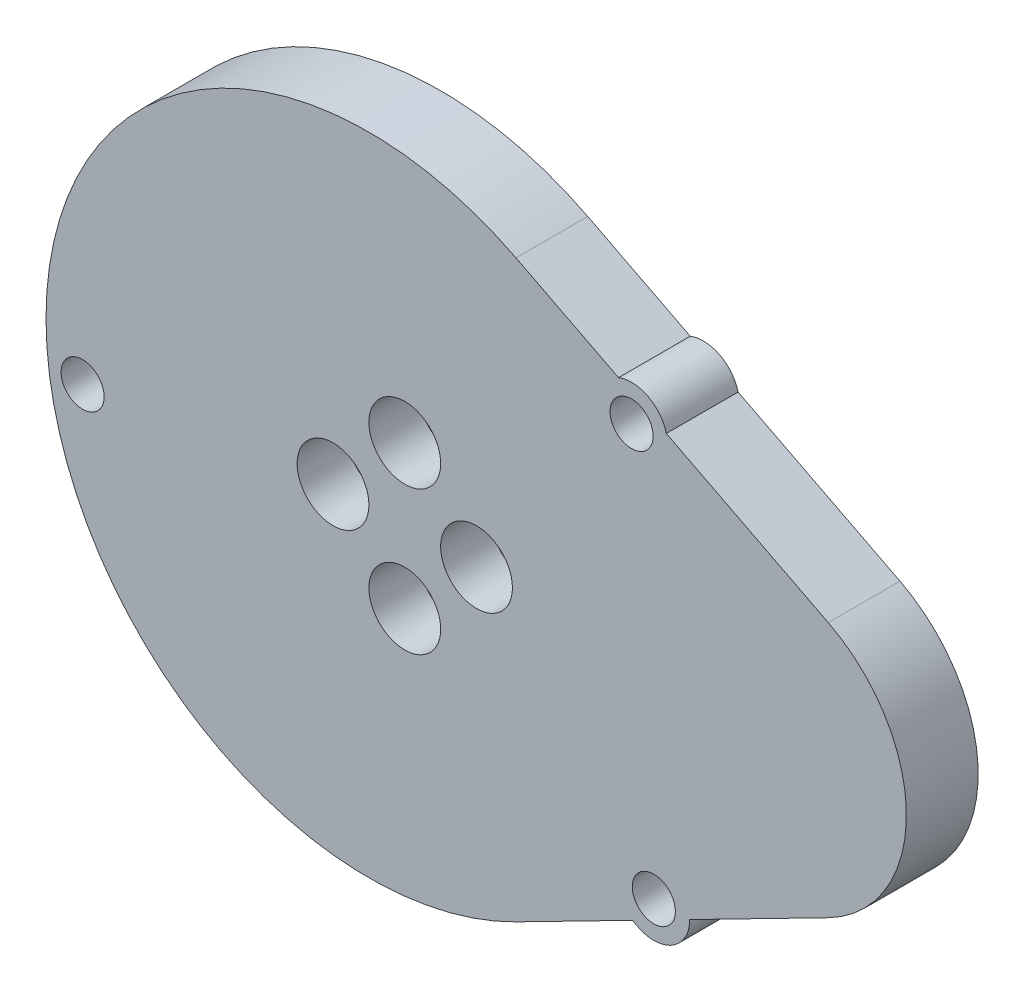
ISO-10303-21;
HEADER;
FILE_DESCRIPTION(('STEP AP214'),'2;1');
FILE_NAME('part.step','',(''),(''),'','','');
FILE_SCHEMA(('AUTOMOTIVE_DESIGN { 1 0 10303 214 1 1 1 1 }'));
ENDSEC;
DATA;
#1=APPLICATION_CONTEXT('core data for automotive mechanical design processes');
#2=APPLICATION_PROTOCOL_DEFINITION('international standard','automotive_design',2000,#1);
#3=PRODUCT_CONTEXT('',#1,'mechanical');
#4=PRODUCT('Part','Part','',(#3));
#5=PRODUCT_RELATED_PRODUCT_CATEGORY('part','',(#4));
#6=PRODUCT_DEFINITION_FORMATION('','',#4);
#7=PRODUCT_DEFINITION_CONTEXT('part definition',#1,'design');
#8=PRODUCT_DEFINITION('design','',#6,#7);
#9=PRODUCT_DEFINITION_SHAPE('','',#8);
#10=(LENGTH_UNIT() NAMED_UNIT(*) SI_UNIT(.MILLI.,.METRE.));
#11=(NAMED_UNIT(*) PLANE_ANGLE_UNIT() SI_UNIT($,.RADIAN.));
#12=(NAMED_UNIT(*) SI_UNIT($,.STERADIAN.) SOLID_ANGLE_UNIT());
#13=UNCERTAINTY_MEASURE_WITH_UNIT(LENGTH_MEASURE(1.E-05),#10,'distance_accuracy_value','');
#14=(GEOMETRIC_REPRESENTATION_CONTEXT(3) GLOBAL_UNCERTAINTY_ASSIGNED_CONTEXT((#13)) GLOBAL_UNIT_ASSIGNED_CONTEXT((#10,
#11,#12)) REPRESENTATION_CONTEXT('',''));
#15=CARTESIAN_POINT('',(0.,0.,0.));
#16=DIRECTION('',(0.,0.,1.));
#17=DIRECTION('',(1.,0.,0.));
#18=AXIS2_PLACEMENT_3D('',#15,#16,#17);
#19=CARTESIAN_POINT('',(-44.8955567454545,-5.4,10.));
#20=DIRECTION('',(0.,0.,-1.));
#21=DIRECTION('',(-1.,0.,0.));
#22=AXIS2_PLACEMENT_3D('',#19,#20,#21);
#23=CYLINDRICAL_SURFACE('',#22,1.5);
#24=CARTESIAN_POINT('',(-44.8955567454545,-5.4,2.));
#25=DIRECTION('',(0.,0.,1.));
#26=DIRECTION('',(1.,0.,0.));
#27=AXIS2_PLACEMENT_3D('',#24,#25,#26);
#28=CIRCLE('',#27,1.5);
#29=CARTESIAN_POINT('',(-43.3955567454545,-5.4,2.));
#30=VERTEX_POINT('',#29);
#31=EDGE_CURVE('E180',#30,#30,#28,.T.);
#32=ORIENTED_EDGE('',*,*,#31,.F.);
#33=EDGE_LOOP('',(#32));
#34=FACE_BOUND('',#33,.T.);
#35=CARTESIAN_POINT('',(-44.8955567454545,-5.4,4.));
#36=DIRECTION('',(0.,0.,1.));
#37=DIRECTION('',(1.,0.,0.));
#38=AXIS2_PLACEMENT_3D('',#35,#36,#37);
#39=CIRCLE('',#38,1.5);
#40=CARTESIAN_POINT('',(-43.3955567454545,-5.4,4.));
#41=VERTEX_POINT('',#40);
#42=EDGE_CURVE('E141',#41,#41,#39,.T.);
#43=ORIENTED_EDGE('',*,*,#42,.T.);
#44=EDGE_LOOP('',(#43));
#45=FACE_BOUND('',#44,.T.);
#46=ADVANCED_FACE('F38',(#34,#45),#23,.F.);
#47=CARTESIAN_POINT('',(34.7044432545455,-27.7,10.));
#48=DIRECTION('',(0.,0.,-1.));
#49=DIRECTION('',(-1.,0.,0.));
#50=AXIS2_PLACEMENT_3D('',#47,#48,#49);
#51=CYLINDRICAL_SURFACE('',#50,1.5);
#52=CARTESIAN_POINT('',(34.7044432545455,-27.7,2.));
#53=DIRECTION('',(0.,0.,1.));
#54=DIRECTION('',(1.,0.,0.));
#55=AXIS2_PLACEMENT_3D('',#52,#53,#54);
#56=CIRCLE('',#55,1.5);
#57=CARTESIAN_POINT('',(36.2044432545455,-27.7,2.));
#58=VERTEX_POINT('',#57);
#59=EDGE_CURVE('E176',#58,#58,#56,.T.);
#60=ORIENTED_EDGE('',*,*,#59,.F.);
#61=EDGE_LOOP('',(#60));
#62=FACE_BOUND('',#61,.T.);
#63=CARTESIAN_POINT('',(34.7044432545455,-27.7,4.));
#64=DIRECTION('',(0.,0.,1.));
#65=DIRECTION('',(1.,0.,0.));
#66=AXIS2_PLACEMENT_3D('',#63,#64,#65);
#67=CIRCLE('',#66,1.5);
#68=CARTESIAN_POINT('',(36.2044432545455,-27.7,4.));
#69=VERTEX_POINT('',#68);
#70=EDGE_CURVE('E167',#69,#69,#67,.T.);
#71=ORIENTED_EDGE('',*,*,#70,.T.);
#72=EDGE_LOOP('',(#71));
#73=FACE_BOUND('',#72,.T.);
#74=ADVANCED_FACE('F294',(#62,#73),#51,.F.);
#75=CARTESIAN_POINT('',(31.6044432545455,28.1,10.));
#76=DIRECTION('',(0.,0.,-1.));
#77=DIRECTION('',(-1.,0.,0.));
#78=AXIS2_PLACEMENT_3D('',#75,#76,#77);
#79=CYLINDRICAL_SURFACE('',#78,1.5);
#80=CARTESIAN_POINT('',(31.6044432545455,28.1,2.));
#81=DIRECTION('',(0.,0.,1.));
#82=DIRECTION('',(1.,0.,0.));
#83=AXIS2_PLACEMENT_3D('',#80,#81,#82);
#84=CIRCLE('',#83,1.5);
#85=CARTESIAN_POINT('',(33.1044432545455,28.1,2.));
#86=VERTEX_POINT('',#85);
#87=EDGE_CURVE('E173',#86,#86,#84,.T.);
#88=ORIENTED_EDGE('',*,*,#87,.F.);
#89=EDGE_LOOP('',(#88));
#90=FACE_BOUND('',#89,.T.);
#91=CARTESIAN_POINT('',(31.6044432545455,28.1,4.));
#92=DIRECTION('',(0.,0.,1.));
#93=DIRECTION('',(1.,0.,0.));
#94=AXIS2_PLACEMENT_3D('',#91,#92,#93);
#95=CIRCLE('',#94,1.5);
#96=CARTESIAN_POINT('',(33.1044432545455,28.1,4.));
#97=VERTEX_POINT('',#96);
#98=EDGE_CURVE('E164',#97,#97,#95,.T.);
#99=ORIENTED_EDGE('',*,*,#98,.T.);
#100=EDGE_LOOP('',(#99));
#101=FACE_BOUND('',#100,.T.);
#102=ADVANCED_FACE('F301',(#90,#101),#79,.F.);
#103=CARTESIAN_POINT('',(-4.99555674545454,0.,10.));
#104=DIRECTION('',(0.,0.,1.));
#105=DIRECTION('',(1.,0.,0.));
#106=AXIS2_PLACEMENT_3D('',#103,#104,#105);
#107=PLANE('',#106);
#108=CARTESIAN_POINT('',(0.,10.,10.));
#109=DIRECTION('',(0.,0.,1.));
#110=DIRECTION('',(1.,0.,0.));
#111=AXIS2_PLACEMENT_3D('',#108,#109,#110);
#112=CIRCLE('',#111,5.);
#113=CARTESIAN_POINT('',(5.,10.,10.));
#114=VERTEX_POINT('',#113);
#115=EDGE_CURVE('E208',#114,#114,#112,.T.);
#116=ORIENTED_EDGE('',*,*,#115,.F.);
#117=EDGE_LOOP('',(#116));
#118=FACE_BOUND('',#117,.T.);
#119=CARTESIAN_POINT('',(10.,0.,10.));
#120=DIRECTION('',(0.,0.,1.));
#121=DIRECTION('',(1.,0.,0.));
#122=AXIS2_PLACEMENT_3D('',#119,#120,#121);
#123=CIRCLE('',#122,5.);
#124=CARTESIAN_POINT('',(15.,0.,10.));
#125=VERTEX_POINT('',#124);
#126=EDGE_CURVE('E214',#125,#125,#123,.T.);
#127=ORIENTED_EDGE('',*,*,#126,.F.);
#128=EDGE_LOOP('',(#127));
#129=FACE_BOUND('',#128,.T.);
#130=CARTESIAN_POINT('',(0.,-10.,10.));
#131=DIRECTION('',(0.,0.,1.));
#132=DIRECTION('',(1.,0.,0.));
#133=AXIS2_PLACEMENT_3D('',#130,#131,#132);
#134=CIRCLE('',#133,5.);
#135=CARTESIAN_POINT('',(5.,-10.,10.));
#136=VERTEX_POINT('',#135);
#137=EDGE_CURVE('E199',#136,#136,#134,.T.);
#138=ORIENTED_EDGE('',*,*,#137,.F.);
#139=EDGE_LOOP('',(#138));
#140=FACE_BOUND('',#139,.T.);
#141=CARTESIAN_POINT('',(-10.,0.,10.));
#142=DIRECTION('',(0.,0.,1.));
#143=DIRECTION('',(1.,0.,0.));
#144=AXIS2_PLACEMENT_3D('',#141,#142,#143);
#145=CIRCLE('',#144,5.);
#146=CARTESIAN_POINT('',(-5.,0.,10.));
#147=VERTEX_POINT('',#146);
#148=EDGE_CURVE('E217',#147,#147,#145,.T.);
#149=ORIENTED_EDGE('',*,*,#148,.F.);
#150=EDGE_LOOP('',(#149));
#151=FACE_BOUND('',#150,.T.);
#152=CARTESIAN_POINT('',(-44.8955567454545,-5.4,10.));
#153=DIRECTION('',(0.,0.,1.));
#154=DIRECTION('',(1.,0.,0.));
#155=AXIS2_PLACEMENT_3D('',#152,#153,#154);
#156=CIRCLE('',#155,3.);
#157=CARTESIAN_POINT('',(-41.8955567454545,-5.4,10.));
#158=VERTEX_POINT('',#157);
#159=EDGE_CURVE('E244',#158,#158,#156,.T.);
#160=ORIENTED_EDGE('',*,*,#159,.F.);
#161=EDGE_LOOP('',(#160));
#162=FACE_BOUND('',#161,.T.);
#163=CARTESIAN_POINT('',(31.6044432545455,28.1,10.));
#164=DIRECTION('',(0.,0.,1.));
#165=DIRECTION('',(1.,0.,0.));
#166=AXIS2_PLACEMENT_3D('',#163,#164,#165);
#167=CIRCLE('',#166,3.);
#168=CARTESIAN_POINT('',(34.6044432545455,28.1,10.));
#169=VERTEX_POINT('',#168);
#170=EDGE_CURVE('E247',#169,#169,#167,.T.);
#171=ORIENTED_EDGE('',*,*,#170,.F.);
#172=EDGE_LOOP('',(#171));
#173=FACE_BOUND('',#172,.T.);
#174=CARTESIAN_POINT('',(34.7044432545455,-27.7,10.));
#175=DIRECTION('',(0.,0.,1.));
#176=DIRECTION('',(1.,0.,0.));
#177=AXIS2_PLACEMENT_3D('',#174,#175,#176);
#178=CIRCLE('',#177,3.);
#179=CARTESIAN_POINT('',(37.7044432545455,-27.7,10.));
#180=VERTEX_POINT('',#179);
#181=EDGE_CURVE('E253',#180,#180,#178,.T.);
#182=ORIENTED_EDGE('',*,*,#181,.F.);
#183=EDGE_LOOP('',(#182));
#184=FACE_BOUND('',#183,.T.);
#185=CARTESIAN_POINT('',(-4.99555674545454,0.,10.));
#186=DIRECTION('',(0.,0.,1.));
#187=DIRECTION('',(1.,0.,0.));
#188=AXIS2_PLACEMENT_3D('',#185,#186,#187);
#189=CIRCLE('',#188,45.);
#190=CARTESIAN_POINT('',(15.496246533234,40.0635245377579,10.));
#191=VERTEX_POINT('',#190);
#192=CARTESIAN_POINT('',(15.496246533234,-40.0635245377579,10.));
#193=VERTEX_POINT('',#192);
#194=EDGE_CURVE('E152',#191,#193,#189,.T.);
#195=ORIENTED_EDGE('',*,*,#194,.T.);
#196=DIRECTION('',(0.890300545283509,0.455373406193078,0.));
#197=VECTOR('',#196,1.);
#198=CARTESIAN_POINT('',(31.7630847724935,-31.7433167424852,10.));
#199=LINE('',#198,#197);
#200=CARTESIAN_POINT('',(31.7630847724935,-31.7433167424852,10.));
#201=VERTEX_POINT('',#200);
#202=EDGE_CURVE('E100',#193,#201,#199,.T.);
#203=ORIENTED_EDGE('',*,*,#202,.T.);
#204=CARTESIAN_POINT('',(34.7044432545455,-27.7,10.));
#205=DIRECTION('',(0.,0.,1.));
#206=DIRECTION('',(1.,0.,0.));
#207=AXIS2_PLACEMENT_3D('',#204,#205,#206);
#208=CIRCLE('',#207,4.99999999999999);
#209=CARTESIAN_POINT('',(39.7044089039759,-27.6814661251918,10.));
#210=VERTEX_POINT('',#209);
#211=EDGE_CURVE('E260',#201,#210,#208,.T.);
#212=ORIENTED_EDGE('',*,*,#211,.T.);
#213=DIRECTION('',(0.890300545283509,0.455373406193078,0.));
#214=VECTOR('',#213,1.);
#215=CARTESIAN_POINT('',(59.011911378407,-17.8060109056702,10.));
#216=LINE('',#215,#214);
#217=CARTESIAN_POINT('',(59.011911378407,-17.8060109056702,10.));
#218=VERTEX_POINT('',#217);
#219=EDGE_CURVE('E262',#210,#218,#216,.T.);
#220=ORIENTED_EDGE('',*,*,#219,.T.);
#221=CARTESIAN_POINT('',(49.9044432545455,0.,10.));
#222=DIRECTION('',(0.,0.,1.));
#223=DIRECTION('',(1.,0.,0.));
#224=AXIS2_PLACEMENT_3D('',#221,#222,#223);
#225=CIRCLE('',#224,20.);
#226=CARTESIAN_POINT('',(59.011911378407,17.8060109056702,10.));
#227=VERTEX_POINT('',#226);
#228=EDGE_CURVE('E119',#218,#227,#225,.T.);
#229=ORIENTED_EDGE('',*,*,#228,.T.);
#230=DIRECTION('',(-0.890300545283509,0.455373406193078,0.));
#231=VECTOR('',#230,1.);
#232=CARTESIAN_POINT('',(36.4461914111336,29.3479882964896,10.));
#233=LINE('',#232,#231);
#234=CARTESIAN_POINT('',(36.4461914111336,29.3479882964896,10.));
#235=VERTEX_POINT('',#234);
#236=EDGE_CURVE('E113',#227,#235,#233,.T.);
#237=ORIENTED_EDGE('',*,*,#236,.T.);
#238=CARTESIAN_POINT('',(31.6044432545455,28.1,10.));
#239=DIRECTION('',(0.,0.,1.));
#240=DIRECTION('',(1.,0.,0.));
#241=AXIS2_PLACEMENT_3D('',#238,#239,#240);
#242=CIRCLE('',#241,5.);
#243=CARTESIAN_POINT('',(29.7826295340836,32.7562855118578,10.));
#244=VERTEX_POINT('',#243);
#245=EDGE_CURVE('E117',#235,#244,#242,.T.);
#246=ORIENTED_EDGE('',*,*,#245,.T.);
#247=DIRECTION('',(-0.890300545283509,0.455373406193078,0.));
#248=VECTOR('',#247,1.);
#249=CARTESIAN_POINT('',(15.496246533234,40.0635245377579,10.));
#250=LINE('',#249,#248);
#251=EDGE_CURVE('E57',#244,#191,#250,.T.);
#252=ORIENTED_EDGE('',*,*,#251,.T.);
#253=EDGE_LOOP('',(#195,#203,#212,#220,#229,#237,#246,#252));
#254=FACE_BOUND('',#253,.T.);
#255=ADVANCED_FACE('F115',(#118,#129,#140,#151,#162,#173,#184,#254),#107,.T.);
#256=CARTESIAN_POINT('',(-4.99555674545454,0.,0.));
#257=DIRECTION('',(0.,0.,1.));
#258=DIRECTION('',(1.,0.,0.));
#259=AXIS2_PLACEMENT_3D('',#256,#257,#258);
#260=PLANE('',#259);
#261=CARTESIAN_POINT('',(-10.,0.,0.));
#262=DIRECTION('',(0.,0.,1.));
#263=DIRECTION('',(1.,0.,0.));
#264=AXIS2_PLACEMENT_3D('',#261,#262,#263);
#265=CIRCLE('',#264,2.75);
#266=CARTESIAN_POINT('',(-7.25,0.,0.));
#267=VERTEX_POINT('',#266);
#268=EDGE_CURVE('E42',#267,#267,#265,.T.);
#269=ORIENTED_EDGE('',*,*,#268,.T.);
#270=EDGE_LOOP('',(#269));
#271=FACE_BOUND('',#270,.T.);
#272=CARTESIAN_POINT('',(0.,10.,0.));
#273=DIRECTION('',(0.,0.,1.));
#274=DIRECTION('',(1.,0.,0.));
#275=AXIS2_PLACEMENT_3D('',#272,#273,#274);
#276=CIRCLE('',#275,2.75);
#277=CARTESIAN_POINT('',(2.75,10.,0.));
#278=VERTEX_POINT('',#277);
#279=EDGE_CURVE('E190',#278,#278,#276,.T.);
#280=ORIENTED_EDGE('',*,*,#279,.T.);
#281=EDGE_LOOP('',(#280));
#282=FACE_BOUND('',#281,.T.);
#283=CARTESIAN_POINT('',(10.,0.,0.));
#284=DIRECTION('',(0.,0.,1.));
#285=DIRECTION('',(1.,0.,0.));
#286=AXIS2_PLACEMENT_3D('',#283,#284,#285);
#287=CIRCLE('',#286,2.75);
#288=CARTESIAN_POINT('',(12.75,0.,0.));
#289=VERTEX_POINT('',#288);
#290=EDGE_CURVE('E187',#289,#289,#287,.T.);
#291=ORIENTED_EDGE('',*,*,#290,.T.);
#292=EDGE_LOOP('',(#291));
#293=FACE_BOUND('',#292,.T.);
#294=CARTESIAN_POINT('',(0.,-10.,0.));
#295=DIRECTION('',(0.,0.,1.));
#296=DIRECTION('',(1.,0.,0.));
#297=AXIS2_PLACEMENT_3D('',#294,#295,#296);
#298=CIRCLE('',#297,2.75);
#299=CARTESIAN_POINT('',(2.75,-10.,0.));
#300=VERTEX_POINT('',#299);
#301=EDGE_CURVE('E184',#300,#300,#298,.T.);
#302=ORIENTED_EDGE('',*,*,#301,.T.);
#303=EDGE_LOOP('',(#302));
#304=FACE_BOUND('',#303,.T.);
#305=CARTESIAN_POINT('',(-44.8955567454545,-5.4,0.));
#306=DIRECTION('',(0.,0.,1.));
#307=DIRECTION('',(1.,0.,0.));
#308=AXIS2_PLACEMENT_3D('',#305,#306,#307);
#309=CIRCLE('',#308,3.);
#310=CARTESIAN_POINT('',(-41.8955567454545,-5.4,0.));
#311=VERTEX_POINT('',#310);
#312=EDGE_CURVE('E228',#311,#311,#309,.T.);
#313=ORIENTED_EDGE('',*,*,#312,.T.);
#314=EDGE_LOOP('',(#313));
#315=FACE_BOUND('',#314,.T.);
#316=CARTESIAN_POINT('',(31.6044432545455,28.1,0.));
#317=DIRECTION('',(0.,0.,1.));
#318=DIRECTION('',(1.,0.,0.));
#319=AXIS2_PLACEMENT_3D('',#316,#317,#318);
#320=CIRCLE('',#319,3.);
#321=CARTESIAN_POINT('',(34.6044432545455,28.1,0.));
#322=VERTEX_POINT('',#321);
#323=EDGE_CURVE('E234',#322,#322,#320,.T.);
#324=ORIENTED_EDGE('',*,*,#323,.T.);
#325=EDGE_LOOP('',(#324));
#326=FACE_BOUND('',#325,.T.);
#327=CARTESIAN_POINT('',(34.7044432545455,-27.7,0.));
#328=DIRECTION('',(0.,0.,1.));
#329=DIRECTION('',(1.,0.,0.));
#330=AXIS2_PLACEMENT_3D('',#327,#328,#329);
#331=CIRCLE('',#330,3.);
#332=CARTESIAN_POINT('',(37.7044432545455,-27.7,0.));
#333=VERTEX_POINT('',#332);
#334=EDGE_CURVE('E223',#333,#333,#331,.T.);
#335=ORIENTED_EDGE('',*,*,#334,.T.);
#336=EDGE_LOOP('',(#335));
#337=FACE_BOUND('',#336,.T.);
#338=CARTESIAN_POINT('',(-4.99555674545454,0.,0.));
#339=DIRECTION('',(0.,0.,1.));
#340=DIRECTION('',(1.,0.,0.));
#341=AXIS2_PLACEMENT_3D('',#338,#339,#340);
#342=CIRCLE('',#341,45.);
#343=CARTESIAN_POINT('',(15.496246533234,40.0635245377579,0.));
#344=VERTEX_POINT('',#343);
#345=CARTESIAN_POINT('',(15.496246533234,-40.0635245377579,0.));
#346=VERTEX_POINT('',#345);
#347=EDGE_CURVE('E137',#344,#346,#342,.T.);
#348=ORIENTED_EDGE('',*,*,#347,.F.);
#349=DIRECTION('',(-0.890300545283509,0.455373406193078,0.));
#350=VECTOR('',#349,1.);
#351=CARTESIAN_POINT('',(15.496246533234,40.0635245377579,0.));
#352=LINE('',#351,#350);
#353=CARTESIAN_POINT('',(29.7826295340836,32.7562855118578,0.));
#354=VERTEX_POINT('',#353);
#355=EDGE_CURVE('E92',#354,#344,#352,.T.);
#356=ORIENTED_EDGE('',*,*,#355,.F.);
#357=CARTESIAN_POINT('',(31.6044432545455,28.1,0.));
#358=DIRECTION('',(0.,0.,1.));
#359=DIRECTION('',(1.,0.,0.));
#360=AXIS2_PLACEMENT_3D('',#357,#358,#359);
#361=CIRCLE('',#360,5.);
#362=CARTESIAN_POINT('',(36.4461914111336,29.3479882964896,0.));
#363=VERTEX_POINT('',#362);
#364=EDGE_CURVE('E86',#363,#354,#361,.T.);
#365=ORIENTED_EDGE('',*,*,#364,.F.);
#366=DIRECTION('',(-0.890300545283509,0.455373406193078,0.));
#367=VECTOR('',#366,1.);
#368=CARTESIAN_POINT('',(36.4461914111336,29.3479882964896,0.));
#369=LINE('',#368,#367);
#370=CARTESIAN_POINT('',(59.011911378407,17.8060109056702,0.));
#371=VERTEX_POINT('',#370);
#372=EDGE_CURVE('E127',#371,#363,#369,.T.);
#373=ORIENTED_EDGE('',*,*,#372,.F.);
#374=CARTESIAN_POINT('',(49.9044432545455,0.,0.));
#375=DIRECTION('',(0.,0.,1.));
#376=DIRECTION('',(1.,0.,0.));
#377=AXIS2_PLACEMENT_3D('',#374,#375,#376);
#378=CIRCLE('',#377,20.);
#379=CARTESIAN_POINT('',(59.011911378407,-17.8060109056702,0.));
#380=VERTEX_POINT('',#379);
#381=EDGE_CURVE('E147',#380,#371,#378,.T.);
#382=ORIENTED_EDGE('',*,*,#381,.F.);
#383=DIRECTION('',(0.890300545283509,0.455373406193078,0.));
#384=VECTOR('',#383,1.);
#385=CARTESIAN_POINT('',(59.011911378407,-17.8060109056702,0.));
#386=LINE('',#385,#384);
#387=CARTESIAN_POINT('',(39.7044089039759,-27.6814661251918,0.));
#388=VERTEX_POINT('',#387);
#389=EDGE_CURVE('E145',#388,#380,#386,.T.);
#390=ORIENTED_EDGE('',*,*,#389,.F.);
#391=CARTESIAN_POINT('',(34.7044432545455,-27.7,0.));
#392=DIRECTION('',(0.,0.,1.));
#393=DIRECTION('',(1.,0.,0.));
#394=AXIS2_PLACEMENT_3D('',#391,#392,#393);
#395=CIRCLE('',#394,4.99999999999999);
#396=CARTESIAN_POINT('',(31.7630847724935,-31.7433167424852,0.));
#397=VERTEX_POINT('',#396);
#398=EDGE_CURVE('E143',#397,#388,#395,.T.);
#399=ORIENTED_EDGE('',*,*,#398,.F.);
#400=DIRECTION('',(0.890300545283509,0.455373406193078,0.));
#401=VECTOR('',#400,1.);
#402=CARTESIAN_POINT('',(31.7630847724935,-31.7433167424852,0.));
#403=LINE('',#402,#401);
#404=EDGE_CURVE('E140',#346,#397,#403,.T.);
#405=ORIENTED_EDGE('',*,*,#404,.F.);
#406=EDGE_LOOP('',(#348,#356,#365,#373,#382,#390,#399,#405));
#407=FACE_BOUND('',#406,.T.);
#408=ADVANCED_FACE('F275',(#271,#282,#293,#304,#315,#326,#337,#407),#260,.F.);
#409=CARTESIAN_POINT('',(-4.99555674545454,0.,10.));
#410=DIRECTION('',(0.,0.,-1.));
#411=DIRECTION('',(-1.,0.,0.));
#412=AXIS2_PLACEMENT_3D('',#409,#410,#411);
#413=CYLINDRICAL_SURFACE('',#412,45.);
#414=ORIENTED_EDGE('',*,*,#347,.T.);
#415=DIRECTION('',(0.,0.,-1.));
#416=VECTOR('',#415,1.);
#417=CARTESIAN_POINT('',(15.496246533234,-40.0635245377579,10.));
#418=LINE('',#417,#416);
#419=EDGE_CURVE('E11',#193,#346,#418,.T.);
#420=ORIENTED_EDGE('',*,*,#419,.F.);
#421=ORIENTED_EDGE('',*,*,#194,.F.);
#422=DIRECTION('',(0.,0.,-1.));
#423=VECTOR('',#422,1.);
#424=CARTESIAN_POINT('',(15.496246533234,40.0635245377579,10.));
#425=LINE('',#424,#423);
#426=EDGE_CURVE('E133',#191,#344,#425,.T.);
#427=ORIENTED_EDGE('',*,*,#426,.T.);
#428=EDGE_LOOP('',(#414,#420,#421,#427));
#429=FACE_BOUND('',#428,.T.);
#430=ADVANCED_FACE('F40',(#429),#413,.T.);
#431=CARTESIAN_POINT('',(31.7630847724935,-31.7433167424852,10.));
#432=DIRECTION('',(-0.455373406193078,0.890300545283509,0.));
#433=DIRECTION('',(-0.890300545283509,-0.455373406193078,0.));
#434=AXIS2_PLACEMENT_3D('',#431,#432,#433);
#435=PLANE('',#434);
#436=ORIENTED_EDGE('',*,*,#404,.T.);
#437=DIRECTION('',(0.,0.,-1.));
#438=VECTOR('',#437,1.);
#439=CARTESIAN_POINT('',(31.7630847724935,-31.7433167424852,10.));
#440=LINE('',#439,#438);
#441=EDGE_CURVE('E48',#201,#397,#440,.T.);
#442=ORIENTED_EDGE('',*,*,#441,.F.);
#443=ORIENTED_EDGE('',*,*,#202,.F.);
#444=ORIENTED_EDGE('',*,*,#419,.T.);
#445=EDGE_LOOP('',(#436,#442,#443,#444));
#446=FACE_BOUND('',#445,.T.);
#447=ADVANCED_FACE('F316',(#446),#435,.F.);
#448=CARTESIAN_POINT('',(34.7044432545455,-27.7,10.));
#449=DIRECTION('',(0.,0.,-1.));
#450=DIRECTION('',(-1.,0.,0.));
#451=AXIS2_PLACEMENT_3D('',#448,#449,#450);
#452=CYLINDRICAL_SURFACE('',#451,4.99999999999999);
#453=ORIENTED_EDGE('',*,*,#398,.T.);
#454=DIRECTION('',(0.,0.,-1.));
#455=VECTOR('',#454,1.);
#456=CARTESIAN_POINT('',(39.7044089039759,-27.6814661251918,10.));
#457=LINE('',#456,#455);
#458=EDGE_CURVE('E159',#210,#388,#457,.T.);
#459=ORIENTED_EDGE('',*,*,#458,.F.);
#460=ORIENTED_EDGE('',*,*,#211,.F.);
#461=ORIENTED_EDGE('',*,*,#441,.T.);
#462=EDGE_LOOP('',(#453,#459,#460,#461));
#463=FACE_BOUND('',#462,.T.);
#464=ADVANCED_FACE('F663',(#463),#452,.T.);
#465=CARTESIAN_POINT('',(59.011911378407,-17.8060109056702,10.));
#466=DIRECTION('',(-0.455373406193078,0.890300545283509,0.));
#467=DIRECTION('',(-0.890300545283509,-0.455373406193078,0.));
#468=AXIS2_PLACEMENT_3D('',#465,#466,#467);
#469=PLANE('',#468);
#470=ORIENTED_EDGE('',*,*,#389,.T.);
#471=DIRECTION('',(0.,0.,-1.));
#472=VECTOR('',#471,1.);
#473=CARTESIAN_POINT('',(59.011911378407,-17.8060109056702,10.));
#474=LINE('',#473,#472);
#475=EDGE_CURVE('E156',#218,#380,#474,.T.);
#476=ORIENTED_EDGE('',*,*,#475,.F.);
#477=ORIENTED_EDGE('',*,*,#219,.F.);
#478=ORIENTED_EDGE('',*,*,#458,.T.);
#479=EDGE_LOOP('',(#470,#476,#477,#478));
#480=FACE_BOUND('',#479,.T.);
#481=ADVANCED_FACE('F268',(#480),#469,.F.);
#482=CARTESIAN_POINT('',(49.9044432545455,0.,10.));
#483=DIRECTION('',(0.,0.,-1.));
#484=DIRECTION('',(-1.,0.,0.));
#485=AXIS2_PLACEMENT_3D('',#482,#483,#484);
#486=CYLINDRICAL_SURFACE('',#485,20.);
#487=ORIENTED_EDGE('',*,*,#381,.T.);
#488=DIRECTION('',(0.,0.,-1.));
#489=VECTOR('',#488,1.);
#490=CARTESIAN_POINT('',(59.011911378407,17.8060109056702,10.));
#491=LINE('',#490,#489);
#492=EDGE_CURVE('E128',#227,#371,#491,.T.);
#493=ORIENTED_EDGE('',*,*,#492,.F.);
#494=ORIENTED_EDGE('',*,*,#228,.F.);
#495=ORIENTED_EDGE('',*,*,#475,.T.);
#496=EDGE_LOOP('',(#487,#493,#494,#495));
#497=FACE_BOUND('',#496,.T.);
#498=ADVANCED_FACE('F272',(#497),#486,.T.);
#499=CARTESIAN_POINT('',(36.4461914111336,29.3479882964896,10.));
#500=DIRECTION('',(-0.455373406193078,-0.890300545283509,0.));
#501=DIRECTION('',(0.890300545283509,-0.455373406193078,0.));
#502=AXIS2_PLACEMENT_3D('',#499,#500,#501);
#503=PLANE('',#502);
#504=ORIENTED_EDGE('',*,*,#372,.T.);
#505=DIRECTION('',(0.,0.,-1.));
#506=VECTOR('',#505,1.);
#507=CARTESIAN_POINT('',(36.4461914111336,29.3479882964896,10.));
#508=LINE('',#507,#506);
#509=EDGE_CURVE('E124',#235,#363,#508,.T.);
#510=ORIENTED_EDGE('',*,*,#509,.F.);
#511=ORIENTED_EDGE('',*,*,#236,.F.);
#512=ORIENTED_EDGE('',*,*,#492,.T.);
#513=EDGE_LOOP('',(#504,#510,#511,#512));
#514=FACE_BOUND('',#513,.T.);
#515=ADVANCED_FACE('F125',(#514),#503,.F.);
#516=CARTESIAN_POINT('',(31.6044432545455,28.1,10.));
#517=DIRECTION('',(0.,0.,-1.));
#518=DIRECTION('',(-1.,0.,0.));
#519=AXIS2_PLACEMENT_3D('',#516,#517,#518);
#520=CYLINDRICAL_SURFACE('',#519,5.);
#521=ORIENTED_EDGE('',*,*,#364,.T.);
#522=DIRECTION('',(0.,0.,-1.));
#523=VECTOR('',#522,1.);
#524=CARTESIAN_POINT('',(29.7826295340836,32.7562855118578,10.));
#525=LINE('',#524,#523);
#526=EDGE_CURVE('E129',#244,#354,#525,.T.);
#527=ORIENTED_EDGE('',*,*,#526,.F.);
#528=ORIENTED_EDGE('',*,*,#245,.F.);
#529=ORIENTED_EDGE('',*,*,#509,.T.);
#530=EDGE_LOOP('',(#521,#527,#528,#529));
#531=FACE_BOUND('',#530,.T.);
#532=ADVANCED_FACE('F131',(#531),#520,.T.);
#533=CARTESIAN_POINT('',(15.496246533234,40.0635245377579,10.));
#534=DIRECTION('',(-0.455373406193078,-0.890300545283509,0.));
#535=DIRECTION('',(0.890300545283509,-0.455373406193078,0.));
#536=AXIS2_PLACEMENT_3D('',#533,#534,#535);
#537=PLANE('',#536);
#538=ORIENTED_EDGE('',*,*,#355,.T.);
#539=ORIENTED_EDGE('',*,*,#426,.F.);
#540=ORIENTED_EDGE('',*,*,#251,.F.);
#541=ORIENTED_EDGE('',*,*,#526,.T.);
#542=EDGE_LOOP('',(#538,#539,#540,#541));
#543=FACE_BOUND('',#542,.T.);
#544=ADVANCED_FACE('F280',(#543),#537,.F.);
#545=CARTESIAN_POINT('',(31.6044432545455,28.1,4.));
#546=DIRECTION('',(0.,0.,1.));
#547=DIRECTION('',(1.,0.,0.));
#548=AXIS2_PLACEMENT_3D('',#545,#546,#547);
#549=CYLINDRICAL_SURFACE('',#548,3.);
#550=CARTESIAN_POINT('',(31.6044432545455,28.1,4.));
#551=DIRECTION('',(0.,0.,1.));
#552=DIRECTION('',(1.,0.,0.));
#553=AXIS2_PLACEMENT_3D('',#550,#551,#552);
#554=CIRCLE('',#553,3.);
#555=CARTESIAN_POINT('',(34.6044432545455,28.1,4.));
#556=VERTEX_POINT('',#555);
#557=EDGE_CURVE('E250',#556,#556,#554,.T.);
#558=ORIENTED_EDGE('',*,*,#557,.F.);
#559=EDGE_LOOP('',(#558));
#560=FACE_BOUND('',#559,.T.);
#561=ORIENTED_EDGE('',*,*,#170,.T.);
#562=EDGE_LOOP('',(#561));
#563=FACE_BOUND('',#562,.T.);
#564=ADVANCED_FACE('F282',(#560,#563),#549,.F.);
#565=CARTESIAN_POINT('',(31.6044432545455,28.1,4.));
#566=DIRECTION('',(0.,0.,1.));
#567=DIRECTION('',(1.,0.,0.));
#568=AXIS2_PLACEMENT_3D('',#565,#566,#567);
#569=PLANE('',#568);
#570=ORIENTED_EDGE('',*,*,#98,.F.);
#571=EDGE_LOOP('',(#570));
#572=FACE_BOUND('',#571,.T.);
#573=ORIENTED_EDGE('',*,*,#557,.T.);
#574=EDGE_LOOP('',(#573));
#575=FACE_BOUND('',#574,.T.);
#576=ADVANCED_FACE('F288',(#572,#575),#569,.T.);
#577=CARTESIAN_POINT('',(34.7044432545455,-27.7,4.));
#578=DIRECTION('',(0.,0.,1.));
#579=DIRECTION('',(1.,0.,0.));
#580=AXIS2_PLACEMENT_3D('',#577,#578,#579);
#581=CYLINDRICAL_SURFACE('',#580,3.);
#582=CARTESIAN_POINT('',(34.7044432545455,-27.7,4.));
#583=DIRECTION('',(0.,0.,1.));
#584=DIRECTION('',(1.,0.,0.));
#585=AXIS2_PLACEMENT_3D('',#582,#583,#584);
#586=CIRCLE('',#585,3.);
#587=CARTESIAN_POINT('',(37.7044432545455,-27.7,4.));
#588=VERTEX_POINT('',#587);
#589=EDGE_CURVE('E183',#588,#588,#586,.T.);
#590=ORIENTED_EDGE('',*,*,#589,.F.);
#591=EDGE_LOOP('',(#590));
#592=FACE_BOUND('',#591,.T.);
#593=ORIENTED_EDGE('',*,*,#181,.T.);
#594=EDGE_LOOP('',(#593));
#595=FACE_BOUND('',#594,.T.);
#596=ADVANCED_FACE('F352',(#592,#595),#581,.F.);
#597=CARTESIAN_POINT('',(34.7044432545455,-27.7,4.));
#598=DIRECTION('',(0.,0.,1.));
#599=DIRECTION('',(1.,0.,0.));
#600=AXIS2_PLACEMENT_3D('',#597,#598,#599);
#601=PLANE('',#600);
#602=ORIENTED_EDGE('',*,*,#70,.F.);
#603=EDGE_LOOP('',(#602));
#604=FACE_BOUND('',#603,.T.);
#605=ORIENTED_EDGE('',*,*,#589,.T.);
#606=EDGE_LOOP('',(#605));
#607=FACE_BOUND('',#606,.T.);
#608=ADVANCED_FACE('F347',(#604,#607),#601,.T.);
#609=CARTESIAN_POINT('',(-44.8955567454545,-5.4,4.));
#610=DIRECTION('',(0.,0.,1.));
#611=DIRECTION('',(1.,0.,0.));
#612=AXIS2_PLACEMENT_3D('',#609,#610,#611);
#613=CYLINDRICAL_SURFACE('',#612,3.);
#614=CARTESIAN_POINT('',(-44.8955567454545,-5.4,4.));
#615=DIRECTION('',(0.,0.,1.));
#616=DIRECTION('',(1.,0.,0.));
#617=AXIS2_PLACEMENT_3D('',#614,#615,#616);
#618=CIRCLE('',#617,3.);
#619=CARTESIAN_POINT('',(-41.8955567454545,-5.4,4.));
#620=VERTEX_POINT('',#619);
#621=EDGE_CURVE('E168',#620,#620,#618,.T.);
#622=ORIENTED_EDGE('',*,*,#621,.F.);
#623=EDGE_LOOP('',(#622));
#624=FACE_BOUND('',#623,.T.);
#625=ORIENTED_EDGE('',*,*,#159,.T.);
#626=EDGE_LOOP('',(#625));
#627=FACE_BOUND('',#626,.T.);
#628=ADVANCED_FACE('F341',(#624,#627),#613,.F.);
#629=CARTESIAN_POINT('',(-44.8955567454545,-5.4,4.));
#630=DIRECTION('',(0.,0.,1.));
#631=DIRECTION('',(1.,0.,0.));
#632=AXIS2_PLACEMENT_3D('',#629,#630,#631);
#633=PLANE('',#632);
#634=ORIENTED_EDGE('',*,*,#42,.F.);
#635=EDGE_LOOP('',(#634));
#636=FACE_BOUND('',#635,.T.);
#637=ORIENTED_EDGE('',*,*,#621,.T.);
#638=EDGE_LOOP('',(#637));
#639=FACE_BOUND('',#638,.T.);
#640=ADVANCED_FACE('F331',(#636,#639),#633,.T.);
#641=CARTESIAN_POINT('',(34.7044432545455,-27.7,2.));
#642=DIRECTION('',(0.,0.,-1.));
#643=DIRECTION('',(-1.,0.,0.));
#644=AXIS2_PLACEMENT_3D('',#641,#642,#643);
#645=CYLINDRICAL_SURFACE('',#644,3.);
#646=CARTESIAN_POINT('',(34.7044432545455,-27.7,2.));
#647=DIRECTION('',(0.,0.,1.));
#648=DIRECTION('',(1.,0.,0.));
#649=AXIS2_PLACEMENT_3D('',#646,#647,#648);
#650=CIRCLE('',#649,3.);
#651=CARTESIAN_POINT('',(37.7044432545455,-27.7,2.));
#652=VERTEX_POINT('',#651);
#653=EDGE_CURVE('E237',#652,#652,#650,.T.);
#654=ORIENTED_EDGE('',*,*,#653,.T.);
#655=EDGE_LOOP('',(#654));
#656=FACE_BOUND('',#655,.T.);
#657=ORIENTED_EDGE('',*,*,#334,.F.);
#658=EDGE_LOOP('',(#657));
#659=FACE_BOUND('',#658,.T.);
#660=ADVANCED_FACE('F328',(#656,#659),#645,.F.);
#661=CARTESIAN_POINT('',(34.7044432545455,-27.7,2.));
#662=DIRECTION('',(0.,0.,1.));
#663=DIRECTION('',(1.,0.,0.));
#664=AXIS2_PLACEMENT_3D('',#661,#662,#663);
#665=PLANE('',#664);
#666=ORIENTED_EDGE('',*,*,#59,.T.);
#667=EDGE_LOOP('',(#666));
#668=FACE_BOUND('',#667,.T.);
#669=ORIENTED_EDGE('',*,*,#653,.F.);
#670=EDGE_LOOP('',(#669));
#671=FACE_BOUND('',#670,.T.);
#672=ADVANCED_FACE('F330',(#668,#671),#665,.F.);
#673=CARTESIAN_POINT('',(31.6044432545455,28.1,2.));
#674=DIRECTION('',(0.,0.,-1.));
#675=DIRECTION('',(-1.,0.,0.));
#676=AXIS2_PLACEMENT_3D('',#673,#674,#675);
#677=CYLINDRICAL_SURFACE('',#676,3.);
#678=CARTESIAN_POINT('',(31.6044432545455,28.1,2.));
#679=DIRECTION('',(0.,0.,1.));
#680=DIRECTION('',(1.,0.,0.));
#681=AXIS2_PLACEMENT_3D('',#678,#679,#680);
#682=CIRCLE('',#681,3.);
#683=CARTESIAN_POINT('',(34.6044432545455,28.1,2.));
#684=VERTEX_POINT('',#683);
#685=EDGE_CURVE('E231',#684,#684,#682,.T.);
#686=ORIENTED_EDGE('',*,*,#685,.T.);
#687=EDGE_LOOP('',(#686));
#688=FACE_BOUND('',#687,.T.);
#689=ORIENTED_EDGE('',*,*,#323,.F.);
#690=EDGE_LOOP('',(#689));
#691=FACE_BOUND('',#690,.T.);
#692=ADVANCED_FACE('F338',(#688,#691),#677,.F.);
#693=CARTESIAN_POINT('',(31.6044432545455,28.1,2.));
#694=DIRECTION('',(0.,0.,1.));
#695=DIRECTION('',(1.,0.,0.));
#696=AXIS2_PLACEMENT_3D('',#693,#694,#695);
#697=PLANE('',#696);
#698=ORIENTED_EDGE('',*,*,#87,.T.);
#699=EDGE_LOOP('',(#698));
#700=FACE_BOUND('',#699,.T.);
#701=ORIENTED_EDGE('',*,*,#685,.F.);
#702=EDGE_LOOP('',(#701));
#703=FACE_BOUND('',#702,.T.);
#704=ADVANCED_FACE('F374',(#700,#703),#697,.F.);
#705=CARTESIAN_POINT('',(-44.8955567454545,-5.4,2.));
#706=DIRECTION('',(0.,0.,-1.));
#707=DIRECTION('',(-1.,0.,0.));
#708=AXIS2_PLACEMENT_3D('',#705,#706,#707);
#709=CYLINDRICAL_SURFACE('',#708,3.);
#710=CARTESIAN_POINT('',(-44.8955567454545,-5.4,2.));
#711=DIRECTION('',(0.,0.,1.));
#712=DIRECTION('',(1.,0.,0.));
#713=AXIS2_PLACEMENT_3D('',#710,#711,#712);
#714=CIRCLE('',#713,3.);
#715=CARTESIAN_POINT('',(-41.8955567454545,-5.4,2.));
#716=VERTEX_POINT('',#715);
#717=EDGE_CURVE('E177',#716,#716,#714,.T.);
#718=ORIENTED_EDGE('',*,*,#717,.T.);
#719=EDGE_LOOP('',(#718));
#720=FACE_BOUND('',#719,.T.);
#721=ORIENTED_EDGE('',*,*,#312,.F.);
#722=EDGE_LOOP('',(#721));
#723=FACE_BOUND('',#722,.T.);
#724=ADVANCED_FACE('F377',(#720,#723),#709,.F.);
#725=CARTESIAN_POINT('',(-44.8955567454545,-5.4,2.));
#726=DIRECTION('',(0.,0.,1.));
#727=DIRECTION('',(1.,0.,0.));
#728=AXIS2_PLACEMENT_3D('',#725,#726,#727);
#729=PLANE('',#728);
#730=ORIENTED_EDGE('',*,*,#31,.T.);
#731=EDGE_LOOP('',(#730));
#732=FACE_BOUND('',#731,.T.);
#733=ORIENTED_EDGE('',*,*,#717,.F.);
#734=EDGE_LOOP('',(#733));
#735=FACE_BOUND('',#734,.T.);
#736=ADVANCED_FACE('F388',(#732,#735),#729,.F.);
#737=CARTESIAN_POINT('',(-10.,0.,3.));
#738=DIRECTION('',(0.,0.,1.));
#739=DIRECTION('',(1.,0.,0.));
#740=AXIS2_PLACEMENT_3D('',#737,#738,#739);
#741=CYLINDRICAL_SURFACE('',#740,5.);
#742=CARTESIAN_POINT('',(-10.,0.,3.));
#743=DIRECTION('',(0.,0.,1.));
#744=DIRECTION('',(1.,0.,0.));
#745=AXIS2_PLACEMENT_3D('',#742,#743,#744);
#746=CIRCLE('',#745,5.);
#747=CARTESIAN_POINT('',(-5.,0.,3.));
#748=VERTEX_POINT('',#747);
#749=EDGE_CURVE('E220',#748,#748,#746,.T.);
#750=ORIENTED_EDGE('',*,*,#749,.F.);
#751=EDGE_LOOP('',(#750));
#752=FACE_BOUND('',#751,.T.);
#753=ORIENTED_EDGE('',*,*,#148,.T.);
#754=EDGE_LOOP('',(#753));
#755=FACE_BOUND('',#754,.T.);
#756=ADVANCED_FACE('F392',(#752,#755),#741,.F.);
#757=CARTESIAN_POINT('',(-10.,0.,3.));
#758=DIRECTION('',(0.,0.,1.));
#759=DIRECTION('',(1.,0.,0.));
#760=AXIS2_PLACEMENT_3D('',#757,#758,#759);
#761=PLANE('',#760);
#762=CARTESIAN_POINT('',(-10.,0.,3.));
#763=DIRECTION('',(0.,0.,1.));
#764=DIRECTION('',(1.,0.,0.));
#765=AXIS2_PLACEMENT_3D('',#762,#763,#764);
#766=CIRCLE('',#765,2.75);
#767=CARTESIAN_POINT('',(-7.25,0.,3.));
#768=VERTEX_POINT('',#767);
#769=EDGE_CURVE('E188',#768,#768,#766,.T.);
#770=ORIENTED_EDGE('',*,*,#769,.F.);
#771=EDGE_LOOP('',(#770));
#772=FACE_BOUND('',#771,.T.);
#773=ORIENTED_EDGE('',*,*,#749,.T.);
#774=EDGE_LOOP('',(#773));
#775=FACE_BOUND('',#774,.T.);
#776=ADVANCED_FACE('F396',(#772,#775),#761,.T.);
#777=CARTESIAN_POINT('',(0.,-10.,3.));
#778=DIRECTION('',(0.,0.,1.));
#779=DIRECTION('',(1.,0.,0.));
#780=AXIS2_PLACEMENT_3D('',#777,#778,#779);
#781=CYLINDRICAL_SURFACE('',#780,5.);
#782=CARTESIAN_POINT('',(0.,-10.,3.));
#783=DIRECTION('',(0.,0.,1.));
#784=DIRECTION('',(1.,0.,0.));
#785=AXIS2_PLACEMENT_3D('',#782,#783,#784);
#786=CIRCLE('',#785,5.);
#787=CARTESIAN_POINT('',(5.,-10.,3.));
#788=VERTEX_POINT('',#787);
#789=EDGE_CURVE('E195',#788,#788,#786,.T.);
#790=ORIENTED_EDGE('',*,*,#789,.F.);
#791=EDGE_LOOP('',(#790));
#792=FACE_BOUND('',#791,.T.);
#793=ORIENTED_EDGE('',*,*,#137,.T.);
#794=EDGE_LOOP('',(#793));
#795=FACE_BOUND('',#794,.T.);
#796=ADVANCED_FACE('F399',(#792,#795),#781,.F.);
#797=CARTESIAN_POINT('',(0.,-10.,3.));
#798=DIRECTION('',(0.,0.,1.));
#799=DIRECTION('',(1.,0.,0.));
#800=AXIS2_PLACEMENT_3D('',#797,#798,#799);
#801=PLANE('',#800);
#802=CARTESIAN_POINT('',(0.,-10.,3.));
#803=DIRECTION('',(0.,0.,1.));
#804=DIRECTION('',(1.,0.,0.));
#805=AXIS2_PLACEMENT_3D('',#802,#803,#804);
#806=CIRCLE('',#805,2.75);
#807=CARTESIAN_POINT('',(2.75,-10.,3.));
#808=VERTEX_POINT('',#807);
#809=EDGE_CURVE('E450',#808,#808,#806,.T.);
#810=ORIENTED_EDGE('',*,*,#809,.F.);
#811=EDGE_LOOP('',(#810));
#812=FACE_BOUND('',#811,.T.);
#813=ORIENTED_EDGE('',*,*,#789,.T.);
#814=EDGE_LOOP('',(#813));
#815=FACE_BOUND('',#814,.T.);
#816=ADVANCED_FACE('F409',(#812,#815),#801,.T.);
#817=CARTESIAN_POINT('',(10.,0.,3.));
#818=DIRECTION('',(0.,0.,1.));
#819=DIRECTION('',(1.,0.,0.));
#820=AXIS2_PLACEMENT_3D('',#817,#818,#819);
#821=CYLINDRICAL_SURFACE('',#820,5.);
#822=CARTESIAN_POINT('',(10.,0.,3.));
#823=DIRECTION('',(0.,0.,1.));
#824=DIRECTION('',(1.,0.,0.));
#825=AXIS2_PLACEMENT_3D('',#822,#823,#824);
#826=CIRCLE('',#825,5.);
#827=CARTESIAN_POINT('',(15.,0.,3.));
#828=VERTEX_POINT('',#827);
#829=EDGE_CURVE('E211',#828,#828,#826,.T.);
#830=ORIENTED_EDGE('',*,*,#829,.F.);
#831=EDGE_LOOP('',(#830));
#832=FACE_BOUND('',#831,.T.);
#833=ORIENTED_EDGE('',*,*,#126,.T.);
#834=EDGE_LOOP('',(#833));
#835=FACE_BOUND('',#834,.T.);
#836=ADVANCED_FACE('F405',(#832,#835),#821,.F.);
#837=CARTESIAN_POINT('',(10.,0.,3.));
#838=DIRECTION('',(0.,0.,1.));
#839=DIRECTION('',(1.,0.,0.));
#840=AXIS2_PLACEMENT_3D('',#837,#838,#839);
#841=PLANE('',#840);
#842=CARTESIAN_POINT('',(10.,0.,3.));
#843=DIRECTION('',(0.,0.,1.));
#844=DIRECTION('',(1.,0.,0.));
#845=AXIS2_PLACEMENT_3D('',#842,#843,#844);
#846=CIRCLE('',#845,2.75);
#847=CARTESIAN_POINT('',(12.75,0.,3.));
#848=VERTEX_POINT('',#847);
#849=EDGE_CURVE('E446',#848,#848,#846,.T.);
#850=ORIENTED_EDGE('',*,*,#849,.F.);
#851=EDGE_LOOP('',(#850));
#852=FACE_BOUND('',#851,.T.);
#853=ORIENTED_EDGE('',*,*,#829,.T.);
#854=EDGE_LOOP('',(#853));
#855=FACE_BOUND('',#854,.T.);
#856=ADVANCED_FACE('F401',(#852,#855),#841,.T.);
#857=CARTESIAN_POINT('',(0.,10.,3.));
#858=DIRECTION('',(0.,0.,1.));
#859=DIRECTION('',(1.,0.,0.));
#860=AXIS2_PLACEMENT_3D('',#857,#858,#859);
#861=CYLINDRICAL_SURFACE('',#860,5.);
#862=CARTESIAN_POINT('',(0.,10.,3.));
#863=DIRECTION('',(0.,0.,1.));
#864=DIRECTION('',(1.,0.,0.));
#865=AXIS2_PLACEMENT_3D('',#862,#863,#864);
#866=CIRCLE('',#865,5.);
#867=CARTESIAN_POINT('',(5.,10.,3.));
#868=VERTEX_POINT('',#867);
#869=EDGE_CURVE('E204',#868,#868,#866,.T.);
#870=ORIENTED_EDGE('',*,*,#869,.F.);
#871=EDGE_LOOP('',(#870));
#872=FACE_BOUND('',#871,.T.);
#873=ORIENTED_EDGE('',*,*,#115,.T.);
#874=EDGE_LOOP('',(#873));
#875=FACE_BOUND('',#874,.T.);
#876=ADVANCED_FACE('F404',(#872,#875),#861,.F.);
#877=CARTESIAN_POINT('',(0.,10.,3.));
#878=DIRECTION('',(0.,0.,1.));
#879=DIRECTION('',(1.,0.,0.));
#880=AXIS2_PLACEMENT_3D('',#877,#878,#879);
#881=PLANE('',#880);
#882=CARTESIAN_POINT('',(0.,10.,3.));
#883=DIRECTION('',(0.,0.,1.));
#884=DIRECTION('',(1.,0.,0.));
#885=AXIS2_PLACEMENT_3D('',#882,#883,#884);
#886=CIRCLE('',#885,2.75);
#887=CARTESIAN_POINT('',(2.75,10.,3.));
#888=VERTEX_POINT('',#887);
#889=EDGE_CURVE('E443',#888,#888,#886,.T.);
#890=ORIENTED_EDGE('',*,*,#889,.F.);
#891=EDGE_LOOP('',(#890));
#892=FACE_BOUND('',#891,.T.);
#893=ORIENTED_EDGE('',*,*,#869,.T.);
#894=EDGE_LOOP('',(#893));
#895=FACE_BOUND('',#894,.T.);
#896=ADVANCED_FACE('F411',(#892,#895),#881,.T.);
#897=CARTESIAN_POINT('',(0.,-10.,-3.));
#898=DIRECTION('',(0.,0.,1.));
#899=DIRECTION('',(1.,0.,0.));
#900=AXIS2_PLACEMENT_3D('',#897,#898,#899);
#901=CYLINDRICAL_SURFACE('',#900,2.75);
#902=ORIENTED_EDGE('',*,*,#809,.T.);
#903=EDGE_LOOP('',(#902));
#904=FACE_BOUND('',#903,.T.);
#905=ORIENTED_EDGE('',*,*,#301,.F.);
#906=EDGE_LOOP('',(#905));
#907=FACE_BOUND('',#906,.T.);
#908=ADVANCED_FACE('F414',(#904,#907),#901,.F.);
#909=CARTESIAN_POINT('',(10.,0.,-3.));
#910=DIRECTION('',(0.,0.,1.));
#911=DIRECTION('',(1.,0.,0.));
#912=AXIS2_PLACEMENT_3D('',#909,#910,#911);
#913=CYLINDRICAL_SURFACE('',#912,2.75);
#914=ORIENTED_EDGE('',*,*,#849,.T.);
#915=EDGE_LOOP('',(#914));
#916=FACE_BOUND('',#915,.T.);
#917=ORIENTED_EDGE('',*,*,#290,.F.);
#918=EDGE_LOOP('',(#917));
#919=FACE_BOUND('',#918,.T.);
#920=ADVANCED_FACE('F426',(#916,#919),#913,.F.);
#921=CARTESIAN_POINT('',(0.,10.,-3.));
#922=DIRECTION('',(0.,0.,1.));
#923=DIRECTION('',(1.,0.,0.));
#924=AXIS2_PLACEMENT_3D('',#921,#922,#923);
#925=CYLINDRICAL_SURFACE('',#924,2.75);
#926=ORIENTED_EDGE('',*,*,#889,.T.);
#927=EDGE_LOOP('',(#926));
#928=FACE_BOUND('',#927,.T.);
#929=ORIENTED_EDGE('',*,*,#279,.F.);
#930=EDGE_LOOP('',(#929));
#931=FACE_BOUND('',#930,.T.);
#932=ADVANCED_FACE('F430',(#928,#931),#925,.F.);
#933=CARTESIAN_POINT('',(-10.,0.,-3.));
#934=DIRECTION('',(0.,0.,1.));
#935=DIRECTION('',(1.,0.,0.));
#936=AXIS2_PLACEMENT_3D('',#933,#934,#935);
#937=CYLINDRICAL_SURFACE('',#936,2.75);
#938=ORIENTED_EDGE('',*,*,#769,.T.);
#939=EDGE_LOOP('',(#938));
#940=FACE_BOUND('',#939,.T.);
#941=ORIENTED_EDGE('',*,*,#268,.F.);
#942=EDGE_LOOP('',(#941));
#943=FACE_BOUND('',#942,.T.);
#944=ADVANCED_FACE('F434',(#940,#943),#937,.F.);
#945=CLOSED_SHELL('',(#46,#74,#102,#255,#408,#430,#447,#464,#481,#498,#515,#532,#544,#564,#576,
#596,#608,#628,#640,#660,#672,#692,#704,#724,#736,#756,#776,#796,#816,#836,#856,#876,#896,#908,
#920,#932,#944));
#946=MANIFOLD_SOLID_BREP('B2',#945);
#947=ADVANCED_BREP_SHAPE_REPRESENTATION('',(#18,#946),#14);
#948=SHAPE_DEFINITION_REPRESENTATION(#9,#947);
ENDSEC;
END-ISO-10303-21;
